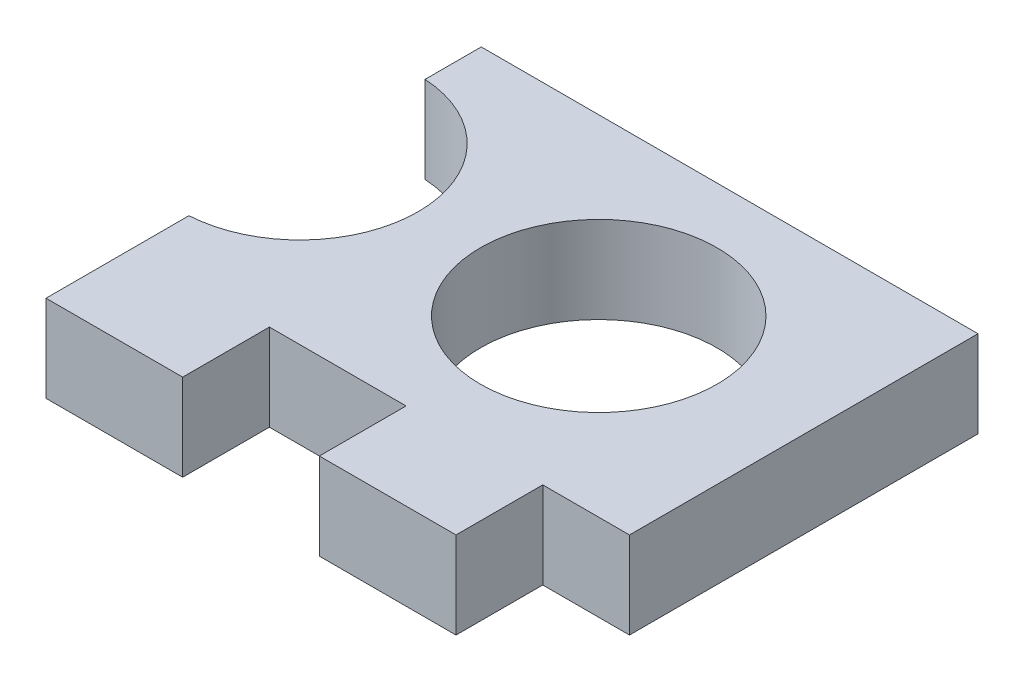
from build123d import *

# Parameters (mm, degrees)
SKETCH1_R           = 7.5
BOSS_EXTRUDE3_DEPTH = 5.5


with BuildPart() as part:
    # Sketch1 → Boss-Extrude3 (new body)
    with BuildSketch(Plane(origin=(0, 0, 0), x_dir=(1, 0, 0), z_dir=(0, 1, 0))):
        with BuildLine():
            Line((-9.589807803, -8.555097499), (-9.589807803, -14.055097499))
            Line((-9.589807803, -14.055097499), (-0.923140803, -14.055097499))
            Line((-0.923140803, -14.055097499), (-0.923140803, -8.555097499))
            Line((-0.923140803, -8.555097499), (7.743525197, -8.555097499))
            Line((7.743525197, -8.555097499), (7.743525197, -14.055097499))
            Line((7.743525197, -14.055097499), (16.410192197, -14.055097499))
            Line((16.410192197, -14.055097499), (16.410192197, -8.555097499))
            Line((16.410192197, -8.555097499), (21.910192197, -8.555097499))
            Line((21.910192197, -8.555097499), (21.910192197, 13.544902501))
            Line((21.910192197, 13.544902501), (-9.589807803, 13.544902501))
            Line((-9.589807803, 13.544902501), (-9.589807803, 9.981390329))
            ThreePointArc((-9.589807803, 9.981390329), (-2.539807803, 2.494902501), (-9.589807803, -4.991585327))
            Line((-9.589807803, -4.991585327), (-9.589807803, -8.555097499))
        make_face()
        with Locations(Location((8.910192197, 2.494902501, 0), (0, 0, 270))):
            Circle(SKETCH1_R, mode=Mode.SUBTRACT)
    extrude(amount=BOSS_EXTRUDE3_DEPTH)


solid = part.part
